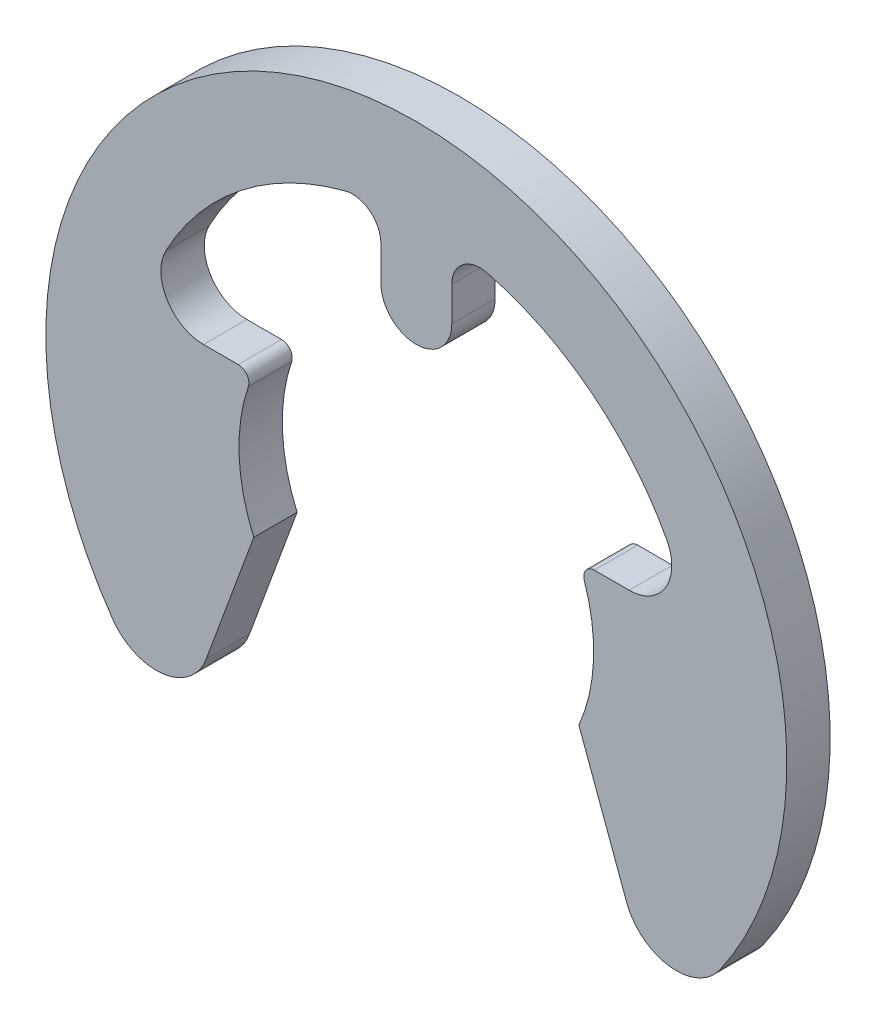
ISO-10303-21;
HEADER;
FILE_DESCRIPTION(('STEP AP214'),'2;1');
FILE_NAME('part.step','',(''),(''),'','','');
FILE_SCHEMA(('AUTOMOTIVE_DESIGN { 1 0 10303 214 1 1 1 1 }'));
ENDSEC;
DATA;
#1=APPLICATION_CONTEXT('core data for automotive mechanical design processes');
#2=APPLICATION_PROTOCOL_DEFINITION('international standard','automotive_design',2000,#1);
#3=PRODUCT_CONTEXT('',#1,'mechanical');
#4=PRODUCT('Part','Part','',(#3));
#5=PRODUCT_RELATED_PRODUCT_CATEGORY('part','',(#4));
#6=PRODUCT_DEFINITION_FORMATION('','',#4);
#7=PRODUCT_DEFINITION_CONTEXT('part definition',#1,'design');
#8=PRODUCT_DEFINITION('design','',#6,#7);
#9=PRODUCT_DEFINITION_SHAPE('','',#8);
#10=(LENGTH_UNIT() NAMED_UNIT(*) SI_UNIT(.MILLI.,.METRE.));
#11=(NAMED_UNIT(*) PLANE_ANGLE_UNIT() SI_UNIT($,.RADIAN.));
#12=(NAMED_UNIT(*) SI_UNIT($,.STERADIAN.) SOLID_ANGLE_UNIT());
#13=UNCERTAINTY_MEASURE_WITH_UNIT(LENGTH_MEASURE(1.E-05),#10,'distance_accuracy_value','');
#14=(GEOMETRIC_REPRESENTATION_CONTEXT(3) GLOBAL_UNCERTAINTY_ASSIGNED_CONTEXT((#13)) GLOBAL_UNIT_ASSIGNED_CONTEXT((#10,
#11,#12)) REPRESENTATION_CONTEXT('',''));
#15=CARTESIAN_POINT('',(0.,0.,0.));
#16=DIRECTION('',(0.,0.,1.));
#17=DIRECTION('',(1.,0.,0.));
#18=AXIS2_PLACEMENT_3D('',#15,#16,#17);
#19=CARTESIAN_POINT('',(0.,-3.64386104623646,0.));
#20=DIRECTION('',(0.,0.,1.));
#21=DIRECTION('',(1.,0.,0.));
#22=AXIS2_PLACEMENT_3D('',#19,#20,#21);
#23=PLANE('',#22);
#24=CARTESIAN_POINT('',(6.59824474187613,-10.587823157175,0.));
#25=DIRECTION('',(0.,0.,1.));
#26=DIRECTION('',(1.,0.,0.));
#27=AXIS2_PLACEMENT_3D('',#24,#25,#26);
#28=CIRCLE('',#27,1.35);
#29=CARTESIAN_POINT('',(5.33140825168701,-11.0543264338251,0.));
#30=VERTEX_POINT('',#29);
#31=CARTESIAN_POINT('',(7.70478267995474,-11.3611754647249,0.));
#32=VERTEX_POINT('',#31);
#33=EDGE_CURVE('E156',#30,#32,#28,.T.);
#34=ORIENTED_EDGE('',*,*,#33,.F.);
#35=DIRECTION('',(0.345557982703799,-0.93839740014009,0.));
#36=VECTOR('',#35,1.);
#37=CARTESIAN_POINT('',(5.33140825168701,-11.0543264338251,0.));
#38=LINE('',#37,#36);
#39=CARTESIAN_POINT('',(4.12431812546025,-7.776351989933,0.));
#40=VERTEX_POINT('',#39);
#41=EDGE_CURVE('E171',#40,#30,#38,.T.);
#42=ORIENTED_EDGE('',*,*,#41,.F.);
#43=CARTESIAN_POINT('',(0.,-5.976351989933,0.));
#44=DIRECTION('',(0.,0.,1.));
#45=DIRECTION('',(1.,0.,0.));
#46=AXIS2_PLACEMENT_3D('',#43,#44,#45);
#47=CIRCLE('',#46,4.5);
#48=CARTESIAN_POINT('',(4.26223032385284,-4.53295576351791,0.));
#49=VERTEX_POINT('',#48);
#50=EDGE_CURVE('E176',#49,#40,#47,.F.);
#51=ORIENTED_EDGE('',*,*,#50,.F.);
#52=CARTESIAN_POINT('',(4.51796414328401,-4.446351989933,0.));
#53=DIRECTION('',(0.,0.,1.));
#54=DIRECTION('',(1.,0.,0.));
#55=AXIS2_PLACEMENT_3D('',#52,#53,#54);
#56=CIRCLE('',#55,0.27);
#57=CARTESIAN_POINT('',(4.51796414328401,-4.176351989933,0.));
#58=VERTEX_POINT('',#57);
#59=EDGE_CURVE('E180',#58,#49,#56,.T.);
#60=ORIENTED_EDGE('',*,*,#59,.F.);
#61=DIRECTION('',(1.,0.,0.));
#62=VECTOR('',#61,1.);
#63=CARTESIAN_POINT('',(4.51796414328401,-4.176351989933,0.));
#64=LINE('',#63,#62);
#65=CARTESIAN_POINT('',(5.4,-4.176351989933,0.));
#66=VERTEX_POINT('',#65);
#67=EDGE_CURVE('E223',#66,#58,#64,.F.);
#68=ORIENTED_EDGE('',*,*,#67,.F.);
#69=CARTESIAN_POINT('',(5.4,-3.096351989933,0.));
#70=DIRECTION('',(0.,0.,1.));
#71=DIRECTION('',(1.,0.,0.));
#72=AXIS2_PLACEMENT_3D('',#69,#70,#71);
#73=CIRCLE('',#72,1.08);
#74=CARTESIAN_POINT('',(6.35294117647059,-2.58811669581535,0.));
#75=VERTEX_POINT('',#74);
#76=EDGE_CURVE('E183',#75,#66,#73,.F.);
#77=ORIENTED_EDGE('',*,*,#76,.F.);
#78=CARTESIAN_POINT('',(0.,-5.976351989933,0.));
#79=DIRECTION('',(0.,0.,1.));
#80=DIRECTION('',(1.,0.,0.));
#81=AXIS2_PLACEMENT_3D('',#78,#79,#80);
#82=CIRCLE('',#81,7.2);
#83=CARTESIAN_POINT('',(1.8,0.99501803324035,0.));
#84=VERTEX_POINT('',#83);
#85=EDGE_CURVE('E187',#84,#75,#82,.F.);
#86=ORIENTED_EDGE('',*,*,#85,.F.);
#87=CARTESIAN_POINT('',(1.62,0.297881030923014,0.));
#88=DIRECTION('',(0.,0.,1.));
#89=DIRECTION('',(1.,0.,0.));
#90=AXIS2_PLACEMENT_3D('',#87,#88,#89);
#91=CIRCLE('',#90,0.72);
#92=CARTESIAN_POINT('',(0.9,0.297881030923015,0.));
#93=VERTEX_POINT('',#92);
#94=EDGE_CURVE('E190',#93,#84,#91,.F.);
#95=ORIENTED_EDGE('',*,*,#94,.F.);
#96=DIRECTION('',(0.,1.,0.));
#97=VECTOR('',#96,1.);
#98=CARTESIAN_POINT('',(0.9,0.297881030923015,0.));
#99=LINE('',#98,#97);
#100=CARTESIAN_POINT('',(0.9,-0.576351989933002,0.));
#101=VERTEX_POINT('',#100);
#102=EDGE_CURVE('E225',#101,#93,#99,.T.);
#103=ORIENTED_EDGE('',*,*,#102,.F.);
#104=CARTESIAN_POINT('',(0.,-0.576351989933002,0.));
#105=DIRECTION('',(0.,0.,1.));
#106=DIRECTION('',(1.,0.,0.));
#107=AXIS2_PLACEMENT_3D('',#104,#105,#106);
#108=CIRCLE('',#107,0.9);
#109=CARTESIAN_POINT('',(-0.9,-0.576351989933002,0.));
#110=VERTEX_POINT('',#109);
#111=EDGE_CURVE('E193',#110,#101,#108,.T.);
#112=ORIENTED_EDGE('',*,*,#111,.F.);
#113=DIRECTION('',(0.,-1.,0.));
#114=VECTOR('',#113,1.);
#115=CARTESIAN_POINT('',(-0.9,-0.576351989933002,0.));
#116=LINE('',#115,#114);
#117=CARTESIAN_POINT('',(-0.9,0.297881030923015,0.));
#118=VERTEX_POINT('',#117);
#119=EDGE_CURVE('E227',#118,#110,#116,.T.);
#120=ORIENTED_EDGE('',*,*,#119,.F.);
#121=CARTESIAN_POINT('',(-1.62,0.297881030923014,0.));
#122=DIRECTION('',(0.,0.,1.));
#123=DIRECTION('',(1.,0.,0.));
#124=AXIS2_PLACEMENT_3D('',#121,#122,#123);
#125=CIRCLE('',#124,0.72);
#126=CARTESIAN_POINT('',(-1.8,0.99501803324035,0.));
#127=VERTEX_POINT('',#126);
#128=EDGE_CURVE('E197',#127,#118,#125,.F.);
#129=ORIENTED_EDGE('',*,*,#128,.F.);
#130=CARTESIAN_POINT('',(0.,-5.976351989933,0.));
#131=DIRECTION('',(0.,0.,1.));
#132=DIRECTION('',(1.,0.,0.));
#133=AXIS2_PLACEMENT_3D('',#130,#131,#132);
#134=CIRCLE('',#133,7.2);
#135=CARTESIAN_POINT('',(-6.35294117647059,-2.58811669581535,0.));
#136=VERTEX_POINT('',#135);
#137=EDGE_CURVE('E201',#136,#127,#134,.F.);
#138=ORIENTED_EDGE('',*,*,#137,.F.);
#139=CARTESIAN_POINT('',(-5.4,-3.096351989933,0.));
#140=DIRECTION('',(0.,0.,1.));
#141=DIRECTION('',(1.,0.,0.));
#142=AXIS2_PLACEMENT_3D('',#139,#140,#141);
#143=CIRCLE('',#142,1.08);
#144=CARTESIAN_POINT('',(-5.4,-4.176351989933,0.));
#145=VERTEX_POINT('',#144);
#146=EDGE_CURVE('E204',#145,#136,#143,.F.);
#147=ORIENTED_EDGE('',*,*,#146,.F.);
#148=DIRECTION('',(1.,0.,0.));
#149=VECTOR('',#148,1.);
#150=CARTESIAN_POINT('',(-5.4,-4.176351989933,0.));
#151=LINE('',#150,#149);
#152=CARTESIAN_POINT('',(-4.51796414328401,-4.176351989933,0.));
#153=VERTEX_POINT('',#152);
#154=EDGE_CURVE('E229',#153,#145,#151,.F.);
#155=ORIENTED_EDGE('',*,*,#154,.F.);
#156=CARTESIAN_POINT('',(-4.51796414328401,-4.446351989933,0.));
#157=DIRECTION('',(0.,0.,1.));
#158=DIRECTION('',(1.,0.,0.));
#159=AXIS2_PLACEMENT_3D('',#156,#157,#158);
#160=CIRCLE('',#159,0.27);
#161=CARTESIAN_POINT('',(-4.26223032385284,-4.53295576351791,0.));
#162=VERTEX_POINT('',#161);
#163=EDGE_CURVE('E207',#162,#153,#160,.T.);
#164=ORIENTED_EDGE('',*,*,#163,.F.);
#165=CARTESIAN_POINT('',(0.,-5.976351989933,0.));
#166=DIRECTION('',(0.,0.,1.));
#167=DIRECTION('',(1.,0.,0.));
#168=AXIS2_PLACEMENT_3D('',#165,#166,#167);
#169=CIRCLE('',#168,4.5);
#170=CARTESIAN_POINT('',(-4.12431812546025,-7.776351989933,0.));
#171=VERTEX_POINT('',#170);
#172=EDGE_CURVE('E211',#171,#162,#169,.F.);
#173=ORIENTED_EDGE('',*,*,#172,.F.);
#174=DIRECTION('',(0.345557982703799,0.93839740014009,0.));
#175=VECTOR('',#174,1.);
#176=CARTESIAN_POINT('',(-4.12431812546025,-7.776351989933,0.));
#177=LINE('',#176,#175);
#178=CARTESIAN_POINT('',(-5.33140825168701,-11.0543264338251,0.));
#179=VERTEX_POINT('',#178);
#180=EDGE_CURVE('E216',#179,#171,#177,.T.);
#181=ORIENTED_EDGE('',*,*,#180,.F.);
#182=CARTESIAN_POINT('',(-6.59824474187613,-10.587823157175,0.));
#183=DIRECTION('',(0.,0.,1.));
#184=DIRECTION('',(1.,0.,0.));
#185=AXIS2_PLACEMENT_3D('',#182,#183,#184);
#186=CIRCLE('',#185,1.35);
#187=CARTESIAN_POINT('',(-7.70478267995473,-11.3611754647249,0.));
#188=VERTEX_POINT('',#187);
#189=EDGE_CURVE('E158',#188,#179,#186,.T.);
#190=ORIENTED_EDGE('',*,*,#189,.F.);
#191=CARTESIAN_POINT('',(0.,-5.976351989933,0.));
#192=DIRECTION('',(0.,0.,1.));
#193=DIRECTION('',(1.,0.,0.));
#194=AXIS2_PLACEMENT_3D('',#191,#192,#193);
#195=CIRCLE('',#194,9.4);
#196=EDGE_CURVE('E21',#32,#188,#195,.T.);
#197=ORIENTED_EDGE('',*,*,#196,.F.);
#198=EDGE_LOOP('',(#34,#42,#51,#60,#68,#77,#86,#95,#103,#112,#120,#129,#138,#147,#155,#164,#173,
#181,#190,#197));
#199=FACE_BOUND('',#198,.T.);
#200=ADVANCED_FACE('F17',(#199),#23,.F.);
#201=CARTESIAN_POINT('',(0.,-5.976351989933,0.));
#202=DIRECTION('',(0.,0.,1.));
#203=DIRECTION('',(1.,0.,0.));
#204=AXIS2_PLACEMENT_3D('',#201,#202,#203);
#205=CYLINDRICAL_SURFACE('',#204,9.4);
#206=ORIENTED_EDGE('',*,*,#196,.T.);
#207=DIRECTION('',(0.,0.,1.));
#208=VECTOR('',#207,1.);
#209=CARTESIAN_POINT('',(-7.70478267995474,-11.3611754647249,0.));
#210=LINE('',#209,#208);
#211=CARTESIAN_POINT('',(-7.70478267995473,-11.3611754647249,1.1));
#212=VERTEX_POINT('',#211);
#213=EDGE_CURVE('E161',#212,#188,#210,.F.);
#214=ORIENTED_EDGE('',*,*,#213,.F.);
#215=CARTESIAN_POINT('',(0.,-5.976351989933,1.1));
#216=DIRECTION('',(0.,0.,1.));
#217=DIRECTION('',(1.,0.,0.));
#218=AXIS2_PLACEMENT_3D('',#215,#216,#217);
#219=CIRCLE('',#218,9.4);
#220=CARTESIAN_POINT('',(7.70478267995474,-11.3611754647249,1.1));
#221=VERTEX_POINT('',#220);
#222=EDGE_CURVE('E166',#221,#212,#219,.T.);
#223=ORIENTED_EDGE('',*,*,#222,.F.);
#224=DIRECTION('',(0.,0.,1.));
#225=VECTOR('',#224,1.);
#226=CARTESIAN_POINT('',(7.70478267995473,-11.3611754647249,0.));
#227=LINE('',#226,#225);
#228=EDGE_CURVE('E163',#32,#221,#227,.T.);
#229=ORIENTED_EDGE('',*,*,#228,.F.);
#230=EDGE_LOOP('',(#206,#214,#223,#229));
#231=FACE_BOUND('',#230,.T.);
#232=ADVANCED_FACE('F164',(#231),#205,.T.);
#233=CARTESIAN_POINT('',(-6.59824474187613,-10.587823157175,0.));
#234=DIRECTION('',(0.,0.,1.));
#235=DIRECTION('',(1.,0.,0.));
#236=AXIS2_PLACEMENT_3D('',#233,#234,#235);
#237=CYLINDRICAL_SURFACE('',#236,1.35);
#238=ORIENTED_EDGE('',*,*,#189,.T.);
#239=DIRECTION('',(0.,0.,1.));
#240=VECTOR('',#239,1.);
#241=CARTESIAN_POINT('',(-5.33140825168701,-11.0543264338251,0.));
#242=LINE('',#241,#240);
#243=CARTESIAN_POINT('',(-5.33140825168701,-11.0543264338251,1.1));
#244=VERTEX_POINT('',#243);
#245=EDGE_CURVE('E213',#244,#179,#242,.F.);
#246=ORIENTED_EDGE('',*,*,#245,.F.);
#247=CARTESIAN_POINT('',(-6.59824474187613,-10.587823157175,1.1));
#248=DIRECTION('',(0.,0.,1.));
#249=DIRECTION('',(1.,0.,0.));
#250=AXIS2_PLACEMENT_3D('',#247,#248,#249);
#251=CIRCLE('',#250,1.35);
#252=EDGE_CURVE('E269',#212,#244,#251,.T.);
#253=ORIENTED_EDGE('',*,*,#252,.F.);
#254=ORIENTED_EDGE('',*,*,#213,.T.);
#255=EDGE_LOOP('',(#238,#246,#253,#254));
#256=FACE_BOUND('',#255,.T.);
#257=ADVANCED_FACE('F496',(#256),#237,.T.);
#258=CARTESIAN_POINT('',(-4.12431812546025,-7.776351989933,0.));
#259=DIRECTION('',(0.93839740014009,-0.345557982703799,0.));
#260=DIRECTION('',(0.345557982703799,0.93839740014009,0.));
#261=AXIS2_PLACEMENT_3D('',#258,#259,#260);
#262=PLANE('',#261);
#263=ORIENTED_EDGE('',*,*,#180,.T.);
#264=DIRECTION('',(0.,0.,1.));
#265=VECTOR('',#264,1.);
#266=CARTESIAN_POINT('',(-4.12431812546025,-7.776351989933,0.));
#267=LINE('',#266,#265);
#268=CARTESIAN_POINT('',(-4.12431812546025,-7.776351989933,1.1));
#269=VERTEX_POINT('',#268);
#270=EDGE_CURVE('E212',#269,#171,#267,.F.);
#271=ORIENTED_EDGE('',*,*,#270,.F.);
#272=DIRECTION('',(0.345557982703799,0.93839740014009,0.));
#273=VECTOR('',#272,1.);
#274=CARTESIAN_POINT('',(-5.33140825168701,-11.0543264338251,1.1));
#275=LINE('',#274,#273);
#276=EDGE_CURVE('E268',#244,#269,#275,.T.);
#277=ORIENTED_EDGE('',*,*,#276,.F.);
#278=ORIENTED_EDGE('',*,*,#245,.T.);
#279=EDGE_LOOP('',(#263,#271,#277,#278));
#280=FACE_BOUND('',#279,.T.);
#281=ADVANCED_FACE('F323',(#280),#262,.T.);
#282=CARTESIAN_POINT('',(0.,-5.976351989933,0.));
#283=DIRECTION('',(0.,0.,1.));
#284=DIRECTION('',(1.,0.,0.));
#285=AXIS2_PLACEMENT_3D('',#282,#283,#284);
#286=CYLINDRICAL_SURFACE('',#285,4.5);
#287=ORIENTED_EDGE('',*,*,#172,.T.);
#288=DIRECTION('',(0.,0.,1.));
#289=VECTOR('',#288,1.);
#290=CARTESIAN_POINT('',(-4.26223032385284,-4.53295576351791,0.));
#291=LINE('',#290,#289);
#292=CARTESIAN_POINT('',(-4.26223032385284,-4.53295576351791,1.1));
#293=VERTEX_POINT('',#292);
#294=EDGE_CURVE('E210',#293,#162,#291,.F.);
#295=ORIENTED_EDGE('',*,*,#294,.F.);
#296=CARTESIAN_POINT('',(0.,-5.976351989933,1.1));
#297=DIRECTION('',(0.,0.,1.));
#298=DIRECTION('',(1.,0.,0.));
#299=AXIS2_PLACEMENT_3D('',#296,#297,#298);
#300=CIRCLE('',#299,4.5);
#301=EDGE_CURVE('E266',#269,#293,#300,.F.);
#302=ORIENTED_EDGE('',*,*,#301,.F.);
#303=ORIENTED_EDGE('',*,*,#270,.T.);
#304=EDGE_LOOP('',(#287,#295,#302,#303));
#305=FACE_BOUND('',#304,.T.);
#306=ADVANCED_FACE('F318',(#305),#286,.F.);
#307=CARTESIAN_POINT('',(-4.51796414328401,-4.446351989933,0.));
#308=DIRECTION('',(0.,0.,1.));
#309=DIRECTION('',(1.,0.,0.));
#310=AXIS2_PLACEMENT_3D('',#307,#308,#309);
#311=CYLINDRICAL_SURFACE('',#310,0.27);
#312=ORIENTED_EDGE('',*,*,#163,.T.);
#313=DIRECTION('',(0.,0.,1.));
#314=VECTOR('',#313,1.);
#315=CARTESIAN_POINT('',(-4.51796414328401,-4.176351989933,0.));
#316=LINE('',#315,#314);
#317=CARTESIAN_POINT('',(-4.51796414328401,-4.176351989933,1.1));
#318=VERTEX_POINT('',#317);
#319=EDGE_CURVE('E209',#318,#153,#316,.F.);
#320=ORIENTED_EDGE('',*,*,#319,.F.);
#321=CARTESIAN_POINT('',(-4.51796414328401,-4.446351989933,1.1));
#322=DIRECTION('',(0.,0.,1.));
#323=DIRECTION('',(1.,0.,0.));
#324=AXIS2_PLACEMENT_3D('',#321,#322,#323);
#325=CIRCLE('',#324,0.27);
#326=EDGE_CURVE('E263',#293,#318,#325,.T.);
#327=ORIENTED_EDGE('',*,*,#326,.F.);
#328=ORIENTED_EDGE('',*,*,#294,.T.);
#329=EDGE_LOOP('',(#312,#320,#327,#328));
#330=FACE_BOUND('',#329,.T.);
#331=ADVANCED_FACE('F328',(#330),#311,.T.);
#332=CARTESIAN_POINT('',(-5.4,-4.176351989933,0.));
#333=DIRECTION('',(0.,1.,0.));
#334=DIRECTION('',(0.,0.,1.));
#335=AXIS2_PLACEMENT_3D('',#332,#333,#334);
#336=PLANE('',#335);
#337=ORIENTED_EDGE('',*,*,#154,.T.);
#338=DIRECTION('',(0.,0.,1.));
#339=VECTOR('',#338,1.);
#340=CARTESIAN_POINT('',(-5.4,-4.176351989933,0.));
#341=LINE('',#340,#339);
#342=CARTESIAN_POINT('',(-5.4,-4.176351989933,1.1));
#343=VERTEX_POINT('',#342);
#344=EDGE_CURVE('E206',#343,#145,#341,.F.);
#345=ORIENTED_EDGE('',*,*,#344,.F.);
#346=DIRECTION('',(1.,0.,0.));
#347=VECTOR('',#346,1.);
#348=CARTESIAN_POINT('',(0.,-4.176351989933,1.1));
#349=LINE('',#348,#347);
#350=EDGE_CURVE('E262',#318,#343,#349,.F.);
#351=ORIENTED_EDGE('',*,*,#350,.F.);
#352=ORIENTED_EDGE('',*,*,#319,.T.);
#353=EDGE_LOOP('',(#337,#345,#351,#352));
#354=FACE_BOUND('',#353,.T.);
#355=ADVANCED_FACE('F332',(#354),#336,.T.);
#356=CARTESIAN_POINT('',(-5.4,-3.096351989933,0.));
#357=DIRECTION('',(0.,0.,1.));
#358=DIRECTION('',(1.,0.,0.));
#359=AXIS2_PLACEMENT_3D('',#356,#357,#358);
#360=CYLINDRICAL_SURFACE('',#359,1.08);
#361=ORIENTED_EDGE('',*,*,#146,.T.);
#362=DIRECTION('',(0.,0.,1.));
#363=VECTOR('',#362,1.);
#364=CARTESIAN_POINT('',(-6.35294117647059,-2.58811669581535,0.));
#365=LINE('',#364,#363);
#366=CARTESIAN_POINT('',(-6.35294117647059,-2.58811669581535,1.1));
#367=VERTEX_POINT('',#366);
#368=EDGE_CURVE('E203',#367,#136,#365,.F.);
#369=ORIENTED_EDGE('',*,*,#368,.F.);
#370=CARTESIAN_POINT('',(-5.4,-3.096351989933,1.1));
#371=DIRECTION('',(0.,0.,1.));
#372=DIRECTION('',(1.,0.,0.));
#373=AXIS2_PLACEMENT_3D('',#370,#371,#372);
#374=CIRCLE('',#373,1.08);
#375=EDGE_CURVE('E259',#343,#367,#374,.F.);
#376=ORIENTED_EDGE('',*,*,#375,.F.);
#377=ORIENTED_EDGE('',*,*,#344,.T.);
#378=EDGE_LOOP('',(#361,#369,#376,#377));
#379=FACE_BOUND('',#378,.T.);
#380=ADVANCED_FACE('F334',(#379),#360,.F.);
#381=CARTESIAN_POINT('',(0.,-5.976351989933,0.));
#382=DIRECTION('',(0.,0.,1.));
#383=DIRECTION('',(1.,0.,0.));
#384=AXIS2_PLACEMENT_3D('',#381,#382,#383);
#385=CYLINDRICAL_SURFACE('',#384,7.2);
#386=ORIENTED_EDGE('',*,*,#137,.T.);
#387=DIRECTION('',(0.,0.,1.));
#388=VECTOR('',#387,1.);
#389=CARTESIAN_POINT('',(-1.8,0.99501803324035,0.));
#390=LINE('',#389,#388);
#391=CARTESIAN_POINT('',(-1.8,0.99501803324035,1.1));
#392=VERTEX_POINT('',#391);
#393=EDGE_CURVE('E200',#392,#127,#390,.F.);
#394=ORIENTED_EDGE('',*,*,#393,.F.);
#395=CARTESIAN_POINT('',(0.,-5.976351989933,1.1));
#396=DIRECTION('',(0.,0.,1.));
#397=DIRECTION('',(1.,0.,0.));
#398=AXIS2_PLACEMENT_3D('',#395,#396,#397);
#399=CIRCLE('',#398,7.2);
#400=EDGE_CURVE('E256',#367,#392,#399,.F.);
#401=ORIENTED_EDGE('',*,*,#400,.F.);
#402=ORIENTED_EDGE('',*,*,#368,.T.);
#403=EDGE_LOOP('',(#386,#394,#401,#402));
#404=FACE_BOUND('',#403,.T.);
#405=ADVANCED_FACE('F338',(#404),#385,.F.);
#406=CARTESIAN_POINT('',(-1.62,0.297881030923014,0.));
#407=DIRECTION('',(0.,0.,1.));
#408=DIRECTION('',(1.,0.,0.));
#409=AXIS2_PLACEMENT_3D('',#406,#407,#408);
#410=CYLINDRICAL_SURFACE('',#409,0.72);
#411=ORIENTED_EDGE('',*,*,#128,.T.);
#412=DIRECTION('',(0.,0.,1.));
#413=VECTOR('',#412,1.);
#414=CARTESIAN_POINT('',(-0.9,0.297881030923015,0.));
#415=LINE('',#414,#413);
#416=CARTESIAN_POINT('',(-0.9,0.297881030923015,1.1));
#417=VERTEX_POINT('',#416);
#418=EDGE_CURVE('E199',#417,#118,#415,.F.);
#419=ORIENTED_EDGE('',*,*,#418,.F.);
#420=CARTESIAN_POINT('',(-1.62,0.297881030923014,1.1));
#421=DIRECTION('',(0.,0.,1.));
#422=DIRECTION('',(1.,0.,0.));
#423=AXIS2_PLACEMENT_3D('',#420,#421,#422);
#424=CIRCLE('',#423,0.72);
#425=EDGE_CURVE('E253',#392,#417,#424,.F.);
#426=ORIENTED_EDGE('',*,*,#425,.F.);
#427=ORIENTED_EDGE('',*,*,#393,.T.);
#428=EDGE_LOOP('',(#411,#419,#426,#427));
#429=FACE_BOUND('',#428,.T.);
#430=ADVANCED_FACE('F342',(#429),#410,.F.);
#431=CARTESIAN_POINT('',(-0.9,-0.576351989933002,0.));
#432=DIRECTION('',(-1.,0.,0.));
#433=DIRECTION('',(0.,-1.,0.));
#434=AXIS2_PLACEMENT_3D('',#431,#432,#433);
#435=PLANE('',#434);
#436=ORIENTED_EDGE('',*,*,#119,.T.);
#437=DIRECTION('',(0.,0.,1.));
#438=VECTOR('',#437,1.);
#439=CARTESIAN_POINT('',(-0.9,-0.576351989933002,0.));
#440=LINE('',#439,#438);
#441=CARTESIAN_POINT('',(-0.9,-0.576351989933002,1.1));
#442=VERTEX_POINT('',#441);
#443=EDGE_CURVE('E196',#442,#110,#440,.F.);
#444=ORIENTED_EDGE('',*,*,#443,.F.);
#445=DIRECTION('',(0.,1.,0.));
#446=VECTOR('',#445,1.);
#447=CARTESIAN_POINT('',(-0.9,-3.64386104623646,1.1));
#448=LINE('',#447,#446);
#449=EDGE_CURVE('E252',#417,#442,#448,.F.);
#450=ORIENTED_EDGE('',*,*,#449,.F.);
#451=ORIENTED_EDGE('',*,*,#418,.T.);
#452=EDGE_LOOP('',(#436,#444,#450,#451));
#453=FACE_BOUND('',#452,.T.);
#454=ADVANCED_FACE('F346',(#453),#435,.T.);
#455=CARTESIAN_POINT('',(0.,-0.576351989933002,0.));
#456=DIRECTION('',(0.,0.,1.));
#457=DIRECTION('',(1.,0.,0.));
#458=AXIS2_PLACEMENT_3D('',#455,#456,#457);
#459=CYLINDRICAL_SURFACE('',#458,0.9);
#460=ORIENTED_EDGE('',*,*,#111,.T.);
#461=DIRECTION('',(0.,0.,1.));
#462=VECTOR('',#461,1.);
#463=CARTESIAN_POINT('',(0.9,-0.576351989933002,0.));
#464=LINE('',#463,#462);
#465=CARTESIAN_POINT('',(0.9,-0.576351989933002,1.1));
#466=VERTEX_POINT('',#465);
#467=EDGE_CURVE('E195',#466,#101,#464,.F.);
#468=ORIENTED_EDGE('',*,*,#467,.F.);
#469=CARTESIAN_POINT('',(0.,-0.576351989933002,1.1));
#470=DIRECTION('',(0.,0.,1.));
#471=DIRECTION('',(1.,0.,0.));
#472=AXIS2_PLACEMENT_3D('',#469,#470,#471);
#473=CIRCLE('',#472,0.9);
#474=EDGE_CURVE('E249',#442,#466,#473,.T.);
#475=ORIENTED_EDGE('',*,*,#474,.F.);
#476=ORIENTED_EDGE('',*,*,#443,.T.);
#477=EDGE_LOOP('',(#460,#468,#475,#476));
#478=FACE_BOUND('',#477,.T.);
#479=ADVANCED_FACE('F350',(#478),#459,.T.);
#480=CARTESIAN_POINT('',(0.9,0.297881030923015,0.));
#481=DIRECTION('',(1.,0.,0.));
#482=DIRECTION('',(0.,1.,0.));
#483=AXIS2_PLACEMENT_3D('',#480,#481,#482);
#484=PLANE('',#483);
#485=ORIENTED_EDGE('',*,*,#102,.T.);
#486=DIRECTION('',(0.,0.,1.));
#487=VECTOR('',#486,1.);
#488=CARTESIAN_POINT('',(0.9,0.297881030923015,0.));
#489=LINE('',#488,#487);
#490=CARTESIAN_POINT('',(0.9,0.297881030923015,1.1));
#491=VERTEX_POINT('',#490);
#492=EDGE_CURVE('E192',#491,#93,#489,.F.);
#493=ORIENTED_EDGE('',*,*,#492,.F.);
#494=DIRECTION('',(0.,1.,0.));
#495=VECTOR('',#494,1.);
#496=CARTESIAN_POINT('',(0.9,-3.64386104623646,1.1));
#497=LINE('',#496,#495);
#498=EDGE_CURVE('E248',#466,#491,#497,.T.);
#499=ORIENTED_EDGE('',*,*,#498,.F.);
#500=ORIENTED_EDGE('',*,*,#467,.T.);
#501=EDGE_LOOP('',(#485,#493,#499,#500));
#502=FACE_BOUND('',#501,.T.);
#503=ADVANCED_FACE('F354',(#502),#484,.T.);
#504=CARTESIAN_POINT('',(1.62,0.297881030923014,0.));
#505=DIRECTION('',(0.,0.,1.));
#506=DIRECTION('',(1.,0.,0.));
#507=AXIS2_PLACEMENT_3D('',#504,#505,#506);
#508=CYLINDRICAL_SURFACE('',#507,0.72);
#509=ORIENTED_EDGE('',*,*,#94,.T.);
#510=DIRECTION('',(0.,0.,1.));
#511=VECTOR('',#510,1.);
#512=CARTESIAN_POINT('',(1.8,0.99501803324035,0.));
#513=LINE('',#512,#511);
#514=CARTESIAN_POINT('',(1.8,0.99501803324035,1.1));
#515=VERTEX_POINT('',#514);
#516=EDGE_CURVE('E189',#515,#84,#513,.F.);
#517=ORIENTED_EDGE('',*,*,#516,.F.);
#518=CARTESIAN_POINT('',(1.62,0.297881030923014,1.1));
#519=DIRECTION('',(0.,0.,1.));
#520=DIRECTION('',(1.,0.,0.));
#521=AXIS2_PLACEMENT_3D('',#518,#519,#520);
#522=CIRCLE('',#521,0.72);
#523=EDGE_CURVE('E245',#491,#515,#522,.F.);
#524=ORIENTED_EDGE('',*,*,#523,.F.);
#525=ORIENTED_EDGE('',*,*,#492,.T.);
#526=EDGE_LOOP('',(#509,#517,#524,#525));
#527=FACE_BOUND('',#526,.T.);
#528=ADVANCED_FACE('F358',(#527),#508,.F.);
#529=CARTESIAN_POINT('',(0.,-5.976351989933,0.));
#530=DIRECTION('',(0.,0.,1.));
#531=DIRECTION('',(1.,0.,0.));
#532=AXIS2_PLACEMENT_3D('',#529,#530,#531);
#533=CYLINDRICAL_SURFACE('',#532,7.2);
#534=ORIENTED_EDGE('',*,*,#85,.T.);
#535=DIRECTION('',(0.,0.,1.));
#536=VECTOR('',#535,1.);
#537=CARTESIAN_POINT('',(6.35294117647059,-2.58811669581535,0.));
#538=LINE('',#537,#536);
#539=CARTESIAN_POINT('',(6.35294117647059,-2.58811669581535,1.1));
#540=VERTEX_POINT('',#539);
#541=EDGE_CURVE('E186',#540,#75,#538,.F.);
#542=ORIENTED_EDGE('',*,*,#541,.F.);
#543=CARTESIAN_POINT('',(0.,-5.976351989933,1.1));
#544=DIRECTION('',(0.,0.,1.));
#545=DIRECTION('',(1.,0.,0.));
#546=AXIS2_PLACEMENT_3D('',#543,#544,#545);
#547=CIRCLE('',#546,7.2);
#548=EDGE_CURVE('E242',#515,#540,#547,.F.);
#549=ORIENTED_EDGE('',*,*,#548,.F.);
#550=ORIENTED_EDGE('',*,*,#516,.T.);
#551=EDGE_LOOP('',(#534,#542,#549,#550));
#552=FACE_BOUND('',#551,.T.);
#553=ADVANCED_FACE('F362',(#552),#533,.F.);
#554=CARTESIAN_POINT('',(5.4,-3.096351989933,0.));
#555=DIRECTION('',(0.,0.,1.));
#556=DIRECTION('',(1.,0.,0.));
#557=AXIS2_PLACEMENT_3D('',#554,#555,#556);
#558=CYLINDRICAL_SURFACE('',#557,1.08);
#559=ORIENTED_EDGE('',*,*,#76,.T.);
#560=DIRECTION('',(0.,0.,1.));
#561=VECTOR('',#560,1.);
#562=CARTESIAN_POINT('',(5.4,-4.176351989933,0.));
#563=LINE('',#562,#561);
#564=CARTESIAN_POINT('',(5.4,-4.176351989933,1.1));
#565=VERTEX_POINT('',#564);
#566=EDGE_CURVE('E185',#565,#66,#563,.F.);
#567=ORIENTED_EDGE('',*,*,#566,.F.);
#568=CARTESIAN_POINT('',(5.4,-3.096351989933,1.1));
#569=DIRECTION('',(0.,0.,1.));
#570=DIRECTION('',(1.,0.,0.));
#571=AXIS2_PLACEMENT_3D('',#568,#569,#570);
#572=CIRCLE('',#571,1.08);
#573=EDGE_CURVE('E239',#540,#565,#572,.F.);
#574=ORIENTED_EDGE('',*,*,#573,.F.);
#575=ORIENTED_EDGE('',*,*,#541,.T.);
#576=EDGE_LOOP('',(#559,#567,#574,#575));
#577=FACE_BOUND('',#576,.T.);
#578=ADVANCED_FACE('F366',(#577),#558,.F.);
#579=CARTESIAN_POINT('',(4.51796414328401,-4.176351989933,0.));
#580=DIRECTION('',(0.,1.,0.));
#581=DIRECTION('',(0.,0.,1.));
#582=AXIS2_PLACEMENT_3D('',#579,#580,#581);
#583=PLANE('',#582);
#584=ORIENTED_EDGE('',*,*,#67,.T.);
#585=DIRECTION('',(0.,0.,1.));
#586=VECTOR('',#585,1.);
#587=CARTESIAN_POINT('',(4.51796414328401,-4.176351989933,0.));
#588=LINE('',#587,#586);
#589=CARTESIAN_POINT('',(4.51796414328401,-4.176351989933,1.1));
#590=VERTEX_POINT('',#589);
#591=EDGE_CURVE('E182',#590,#58,#588,.F.);
#592=ORIENTED_EDGE('',*,*,#591,.F.);
#593=DIRECTION('',(1.,0.,0.));
#594=VECTOR('',#593,1.);
#595=CARTESIAN_POINT('',(0.,-4.176351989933,1.1));
#596=LINE('',#595,#594);
#597=EDGE_CURVE('E238',#565,#590,#596,.F.);
#598=ORIENTED_EDGE('',*,*,#597,.F.);
#599=ORIENTED_EDGE('',*,*,#566,.T.);
#600=EDGE_LOOP('',(#584,#592,#598,#599));
#601=FACE_BOUND('',#600,.T.);
#602=ADVANCED_FACE('F370',(#601),#583,.T.);
#603=CARTESIAN_POINT('',(4.51796414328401,-4.446351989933,0.));
#604=DIRECTION('',(0.,0.,1.));
#605=DIRECTION('',(1.,0.,0.));
#606=AXIS2_PLACEMENT_3D('',#603,#604,#605);
#607=CYLINDRICAL_SURFACE('',#606,0.27);
#608=ORIENTED_EDGE('',*,*,#59,.T.);
#609=DIRECTION('',(0.,0.,1.));
#610=VECTOR('',#609,1.);
#611=CARTESIAN_POINT('',(4.26223032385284,-4.53295576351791,0.));
#612=LINE('',#611,#610);
#613=CARTESIAN_POINT('',(4.26223032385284,-4.53295576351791,1.1));
#614=VERTEX_POINT('',#613);
#615=EDGE_CURVE('E179',#614,#49,#612,.F.);
#616=ORIENTED_EDGE('',*,*,#615,.F.);
#617=CARTESIAN_POINT('',(4.51796414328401,-4.446351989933,1.1));
#618=DIRECTION('',(0.,0.,1.));
#619=DIRECTION('',(1.,0.,0.));
#620=AXIS2_PLACEMENT_3D('',#617,#618,#619);
#621=CIRCLE('',#620,0.27);
#622=EDGE_CURVE('E235',#590,#614,#621,.T.);
#623=ORIENTED_EDGE('',*,*,#622,.F.);
#624=ORIENTED_EDGE('',*,*,#591,.T.);
#625=EDGE_LOOP('',(#608,#616,#623,#624));
#626=FACE_BOUND('',#625,.T.);
#627=ADVANCED_FACE('F374',(#626),#607,.T.);
#628=CARTESIAN_POINT('',(0.,-5.976351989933,0.));
#629=DIRECTION('',(0.,0.,1.));
#630=DIRECTION('',(1.,0.,0.));
#631=AXIS2_PLACEMENT_3D('',#628,#629,#630);
#632=CYLINDRICAL_SURFACE('',#631,4.5);
#633=ORIENTED_EDGE('',*,*,#50,.T.);
#634=DIRECTION('',(0.,0.,1.));
#635=VECTOR('',#634,1.);
#636=CARTESIAN_POINT('',(4.12431812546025,-7.776351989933,0.));
#637=LINE('',#636,#635);
#638=CARTESIAN_POINT('',(4.12431812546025,-7.776351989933,1.1));
#639=VERTEX_POINT('',#638);
#640=EDGE_CURVE('E178',#639,#40,#637,.F.);
#641=ORIENTED_EDGE('',*,*,#640,.F.);
#642=CARTESIAN_POINT('',(0.,-5.976351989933,1.1));
#643=DIRECTION('',(0.,0.,1.));
#644=DIRECTION('',(1.,0.,0.));
#645=AXIS2_PLACEMENT_3D('',#642,#643,#644);
#646=CIRCLE('',#645,4.5);
#647=EDGE_CURVE('E232',#614,#639,#646,.F.);
#648=ORIENTED_EDGE('',*,*,#647,.F.);
#649=ORIENTED_EDGE('',*,*,#615,.T.);
#650=EDGE_LOOP('',(#633,#641,#648,#649));
#651=FACE_BOUND('',#650,.T.);
#652=ADVANCED_FACE('F377',(#651),#632,.F.);
#653=CARTESIAN_POINT('',(5.33140825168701,-11.0543264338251,0.));
#654=DIRECTION('',(-0.93839740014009,-0.345557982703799,0.));
#655=DIRECTION('',(0.345557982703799,-0.93839740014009,0.));
#656=AXIS2_PLACEMENT_3D('',#653,#654,#655);
#657=PLANE('',#656);
#658=ORIENTED_EDGE('',*,*,#41,.T.);
#659=DIRECTION('',(0.,0.,1.));
#660=VECTOR('',#659,1.);
#661=CARTESIAN_POINT('',(5.33140825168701,-11.0543264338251,0.));
#662=LINE('',#661,#660);
#663=CARTESIAN_POINT('',(5.33140825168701,-11.0543264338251,1.1));
#664=VERTEX_POINT('',#663);
#665=EDGE_CURVE('E36',#664,#30,#662,.F.);
#666=ORIENTED_EDGE('',*,*,#665,.F.);
#667=DIRECTION('',(0.345557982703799,-0.93839740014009,0.));
#668=VECTOR('',#667,1.);
#669=CARTESIAN_POINT('',(4.12431812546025,-7.776351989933,1.1));
#670=LINE('',#669,#668);
#671=EDGE_CURVE('E27',#639,#664,#670,.T.);
#672=ORIENTED_EDGE('',*,*,#671,.F.);
#673=ORIENTED_EDGE('',*,*,#640,.T.);
#674=EDGE_LOOP('',(#658,#666,#672,#673));
#675=FACE_BOUND('',#674,.T.);
#676=ADVANCED_FACE('F378',(#675),#657,.T.);
#677=CARTESIAN_POINT('',(6.59824474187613,-10.587823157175,0.));
#678=DIRECTION('',(0.,0.,1.));
#679=DIRECTION('',(1.,0.,0.));
#680=AXIS2_PLACEMENT_3D('',#677,#678,#679);
#681=CYLINDRICAL_SURFACE('',#680,1.35);
#682=ORIENTED_EDGE('',*,*,#33,.T.);
#683=ORIENTED_EDGE('',*,*,#228,.T.);
#684=CARTESIAN_POINT('',(6.59824474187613,-10.587823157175,1.1));
#685=DIRECTION('',(0.,0.,1.));
#686=DIRECTION('',(1.,0.,0.));
#687=AXIS2_PLACEMENT_3D('',#684,#685,#686);
#688=CIRCLE('',#687,1.35);
#689=EDGE_CURVE('E11',#664,#221,#688,.T.);
#690=ORIENTED_EDGE('',*,*,#689,.F.);
#691=ORIENTED_EDGE('',*,*,#665,.T.);
#692=EDGE_LOOP('',(#682,#683,#690,#691));
#693=FACE_BOUND('',#692,.T.);
#694=ADVANCED_FACE('F169',(#693),#681,.T.);
#695=CARTESIAN_POINT('',(0.,-3.64386104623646,1.1));
#696=DIRECTION('',(0.,0.,1.));
#697=DIRECTION('',(1.,0.,0.));
#698=AXIS2_PLACEMENT_3D('',#695,#696,#697);
#699=PLANE('',#698);
#700=ORIENTED_EDGE('',*,*,#671,.T.);
#701=ORIENTED_EDGE('',*,*,#689,.T.);
#702=ORIENTED_EDGE('',*,*,#222,.T.);
#703=ORIENTED_EDGE('',*,*,#252,.T.);
#704=ORIENTED_EDGE('',*,*,#276,.T.);
#705=ORIENTED_EDGE('',*,*,#301,.T.);
#706=ORIENTED_EDGE('',*,*,#326,.T.);
#707=ORIENTED_EDGE('',*,*,#350,.T.);
#708=ORIENTED_EDGE('',*,*,#375,.T.);
#709=ORIENTED_EDGE('',*,*,#400,.T.);
#710=ORIENTED_EDGE('',*,*,#425,.T.);
#711=ORIENTED_EDGE('',*,*,#449,.T.);
#712=ORIENTED_EDGE('',*,*,#474,.T.);
#713=ORIENTED_EDGE('',*,*,#498,.T.);
#714=ORIENTED_EDGE('',*,*,#523,.T.);
#715=ORIENTED_EDGE('',*,*,#548,.T.);
#716=ORIENTED_EDGE('',*,*,#573,.T.);
#717=ORIENTED_EDGE('',*,*,#597,.T.);
#718=ORIENTED_EDGE('',*,*,#622,.T.);
#719=ORIENTED_EDGE('',*,*,#647,.T.);
#720=EDGE_LOOP('',(#700,#701,#702,#703,#704,#705,#706,#707,#708,#709,#710,#711,#712,#713,#714,
#715,#716,#717,#718,#719));
#721=FACE_BOUND('',#720,.T.);
#722=ADVANCED_FACE('F19',(#721),#699,.T.);
#723=CLOSED_SHELL('',(#200,#232,#257,#281,#306,#331,#355,#380,#405,#430,#454,#479,#503,#528,
#553,#578,#602,#627,#652,#676,#694,#722));
#724=MANIFOLD_SOLID_BREP('B1',#723);
#725=ADVANCED_BREP_SHAPE_REPRESENTATION('',(#18,#724),#14);
#726=SHAPE_DEFINITION_REPRESENTATION(#9,#725);
ENDSEC;
END-ISO-10303-21;
